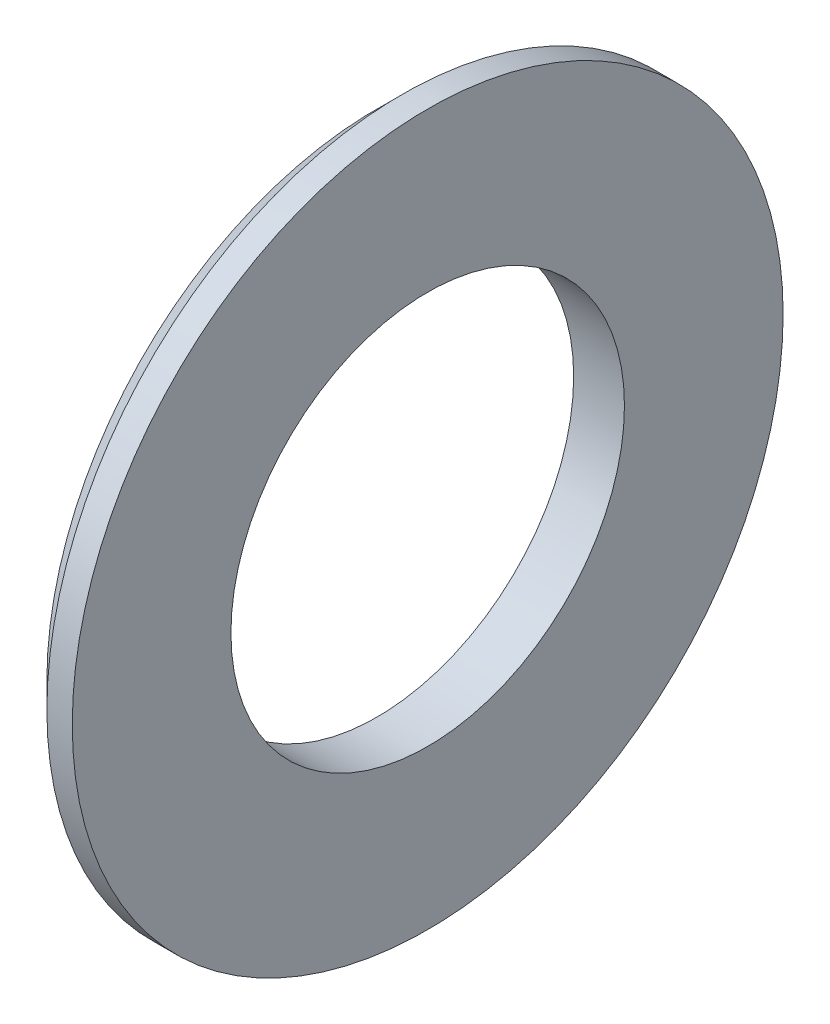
ISO-10303-21;
HEADER;
FILE_DESCRIPTION(('STEP AP214'),'2;1');
FILE_NAME('part.step','',(''),(''),'','','');
FILE_SCHEMA(('AUTOMOTIVE_DESIGN { 1 0 10303 214 1 1 1 1 }'));
ENDSEC;
DATA;
#1=APPLICATION_CONTEXT('core data for automotive mechanical design processes');
#2=APPLICATION_PROTOCOL_DEFINITION('international standard','automotive_design',2000,#1);
#3=PRODUCT_CONTEXT('',#1,'mechanical');
#4=PRODUCT('Part','Part','',(#3));
#5=PRODUCT_RELATED_PRODUCT_CATEGORY('part','',(#4));
#6=PRODUCT_DEFINITION_FORMATION('','',#4);
#7=PRODUCT_DEFINITION_CONTEXT('part definition',#1,'design');
#8=PRODUCT_DEFINITION('design','',#6,#7);
#9=PRODUCT_DEFINITION_SHAPE('','',#8);
#10=(LENGTH_UNIT() NAMED_UNIT(*) SI_UNIT(.MILLI.,.METRE.));
#11=(NAMED_UNIT(*) PLANE_ANGLE_UNIT() SI_UNIT($,.RADIAN.));
#12=(NAMED_UNIT(*) SI_UNIT($,.STERADIAN.) SOLID_ANGLE_UNIT());
#13=UNCERTAINTY_MEASURE_WITH_UNIT(LENGTH_MEASURE(1.E-05),#10,'distance_accuracy_value','');
#14=(GEOMETRIC_REPRESENTATION_CONTEXT(3) GLOBAL_UNCERTAINTY_ASSIGNED_CONTEXT((#13)) GLOBAL_UNIT_ASSIGNED_CONTEXT((#10,
#11,#12)) REPRESENTATION_CONTEXT('',''));
#15=CARTESIAN_POINT('',(0.,0.,0.));
#16=DIRECTION('',(0.,0.,1.));
#17=DIRECTION('',(1.,0.,0.));
#18=AXIS2_PLACEMENT_3D('',#15,#16,#17);
#19=CARTESIAN_POINT('',(-34.9249999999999,0.,0.));
#20=DIRECTION('',(-1.,0.,0.));
#21=DIRECTION('',(0.,0.,1.));
#22=AXIS2_PLACEMENT_3D('',#19,#20,#21);
#23=CYLINDRICAL_SURFACE('',#22,15.5);
#24=CARTESIAN_POINT('',(0.,0.,0.));
#25=DIRECTION('',(-1.,0.,0.));
#26=DIRECTION('',(0.,0.,1.));
#27=AXIS2_PLACEMENT_3D('',#24,#25,#26);
#28=CIRCLE('',#27,15.5);
#29=CARTESIAN_POINT('',(0.,0.,15.5));
#30=VERTEX_POINT('',#29);
#31=EDGE_CURVE('E10',#30,#30,#28,.T.);
#32=ORIENTED_EDGE('',*,*,#31,.F.);
#33=EDGE_LOOP('',(#32));
#34=FACE_BOUND('',#33,.T.);
#35=CARTESIAN_POINT('',(-4.,0.,0.));
#36=DIRECTION('',(-1.,0.,0.));
#37=DIRECTION('',(0.,0.,1.));
#38=AXIS2_PLACEMENT_3D('',#35,#36,#37);
#39=CIRCLE('',#38,15.5);
#40=CARTESIAN_POINT('',(-4.,0.,15.5));
#41=VERTEX_POINT('',#40);
#42=EDGE_CURVE('E49',#41,#41,#39,.T.);
#43=ORIENTED_EDGE('',*,*,#42,.T.);
#44=EDGE_LOOP('',(#43));
#45=FACE_BOUND('',#44,.T.);
#46=ADVANCED_FACE('F30',(#34,#45),#23,.F.);
#47=CARTESIAN_POINT('',(0.,15.5,0.));
#48=DIRECTION('',(-1.,0.,0.));
#49=DIRECTION('',(0.,0.,1.));
#50=AXIS2_PLACEMENT_3D('',#47,#48,#49);
#51=PLANE('',#50);
#52=CARTESIAN_POINT('',(0.,0.,0.));
#53=DIRECTION('',(-1.,0.,0.));
#54=DIRECTION('',(0.,0.,1.));
#55=AXIS2_PLACEMENT_3D('',#52,#53,#54);
#56=CIRCLE('',#55,28.);
#57=CARTESIAN_POINT('',(0.,0.,28.));
#58=VERTEX_POINT('',#57);
#59=EDGE_CURVE('E36',#58,#58,#56,.T.);
#60=ORIENTED_EDGE('',*,*,#59,.F.);
#61=EDGE_LOOP('',(#60));
#62=FACE_BOUND('',#61,.T.);
#63=ORIENTED_EDGE('',*,*,#31,.T.);
#64=EDGE_LOOP('',(#63));
#65=FACE_BOUND('',#64,.T.);
#66=ADVANCED_FACE('F68',(#62,#65),#51,.F.);
#67=CARTESIAN_POINT('',(-34.9249999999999,0.,0.));
#68=DIRECTION('',(-1.,0.,0.));
#69=DIRECTION('',(0.,0.,1.));
#70=AXIS2_PLACEMENT_3D('',#67,#68,#69);
#71=CYLINDRICAL_SURFACE('',#70,28.);
#72=CARTESIAN_POINT('',(-2.,0.,0.));
#73=DIRECTION('',(-1.,0.,0.));
#74=DIRECTION('',(0.,0.,1.));
#75=AXIS2_PLACEMENT_3D('',#72,#73,#74);
#76=CIRCLE('',#75,28.);
#77=CARTESIAN_POINT('',(-2.,0.,28.));
#78=VERTEX_POINT('',#77);
#79=EDGE_CURVE('E40',#78,#78,#76,.T.);
#80=ORIENTED_EDGE('',*,*,#79,.F.);
#81=EDGE_LOOP('',(#80));
#82=FACE_BOUND('',#81,.T.);
#83=ORIENTED_EDGE('',*,*,#59,.T.);
#84=EDGE_LOOP('',(#83));
#85=FACE_BOUND('',#84,.T.);
#86=ADVANCED_FACE('F62',(#82,#85),#71,.T.);
#87=CARTESIAN_POINT('',(-4.,0.,0.));
#88=DIRECTION('',(1.,0.,0.));
#89=DIRECTION('',(0.,0.,-1.));
#90=AXIS2_PLACEMENT_3D('',#87,#88,#89);
#91=CONICAL_SURFACE('',#90,26.,0.785398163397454);
#92=ORIENTED_EDGE('',*,*,#79,.T.);
#93=EDGE_LOOP('',(#92));
#94=FACE_BOUND('',#93,.T.);
#95=CARTESIAN_POINT('',(-4.,0.,0.));
#96=DIRECTION('',(-1.,0.,0.));
#97=DIRECTION('',(0.,0.,1.));
#98=AXIS2_PLACEMENT_3D('',#95,#96,#97);
#99=CIRCLE('',#98,26.);
#100=CARTESIAN_POINT('',(-4.,0.,26.));
#101=VERTEX_POINT('',#100);
#102=EDGE_CURVE('E44',#101,#101,#99,.T.);
#103=ORIENTED_EDGE('',*,*,#102,.F.);
#104=EDGE_LOOP('',(#103));
#105=FACE_BOUND('',#104,.T.);
#106=ADVANCED_FACE('F57',(#94,#105),#91,.T.);
#107=CARTESIAN_POINT('',(-4.,26.,0.));
#108=DIRECTION('',(1.,0.,0.));
#109=DIRECTION('',(0.,0.,-1.));
#110=AXIS2_PLACEMENT_3D('',#107,#108,#109);
#111=PLANE('',#110);
#112=ORIENTED_EDGE('',*,*,#42,.F.);
#113=EDGE_LOOP('',(#112));
#114=FACE_BOUND('',#113,.T.);
#115=ORIENTED_EDGE('',*,*,#102,.T.);
#116=EDGE_LOOP('',(#115));
#117=FACE_BOUND('',#116,.T.);
#118=ADVANCED_FACE('F54',(#114,#117),#111,.F.);
#119=CLOSED_SHELL('',(#46,#66,#86,#106,#118));
#120=MANIFOLD_SOLID_BREP('B2',#119);
#121=ADVANCED_BREP_SHAPE_REPRESENTATION('',(#18,#120),#14);
#122=SHAPE_DEFINITION_REPRESENTATION(#9,#121);
ENDSEC;
END-ISO-10303-21;
